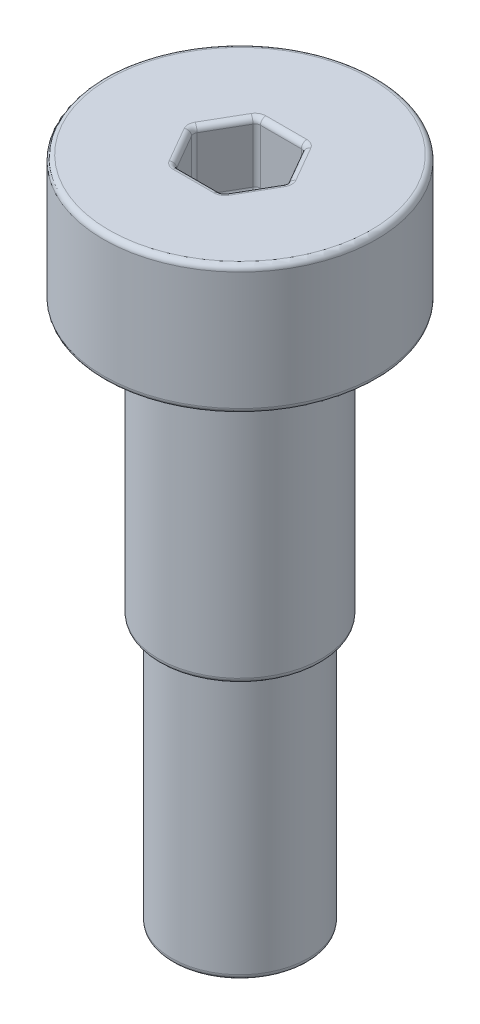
ISO-10303-21;
HEADER;
FILE_DESCRIPTION(('STEP AP214'),'2;1');
FILE_NAME('part.step','',(''),(''),'','','');
FILE_SCHEMA(('AUTOMOTIVE_DESIGN { 1 0 10303 214 1 1 1 1 }'));
ENDSEC;
DATA;
#1=APPLICATION_CONTEXT('core data for automotive mechanical design processes');
#2=APPLICATION_PROTOCOL_DEFINITION('international standard','automotive_design',2000,#1);
#3=PRODUCT_CONTEXT('',#1,'mechanical');
#4=PRODUCT('Part','Part','',(#3));
#5=PRODUCT_RELATED_PRODUCT_CATEGORY('part','',(#4));
#6=PRODUCT_DEFINITION_FORMATION('','',#4);
#7=PRODUCT_DEFINITION_CONTEXT('part definition',#1,'design');
#8=PRODUCT_DEFINITION('design','',#6,#7);
#9=PRODUCT_DEFINITION_SHAPE('','',#8);
#10=(LENGTH_UNIT() NAMED_UNIT(*) SI_UNIT(.MILLI.,.METRE.));
#11=(NAMED_UNIT(*) PLANE_ANGLE_UNIT() SI_UNIT($,.RADIAN.));
#12=(NAMED_UNIT(*) SI_UNIT($,.STERADIAN.) SOLID_ANGLE_UNIT());
#13=UNCERTAINTY_MEASURE_WITH_UNIT(LENGTH_MEASURE(1.E-05),#10,'distance_accuracy_value','');
#14=(GEOMETRIC_REPRESENTATION_CONTEXT(3) GLOBAL_UNCERTAINTY_ASSIGNED_CONTEXT((#13)) GLOBAL_UNIT_ASSIGNED_CONTEXT((#10,
#11,#12)) REPRESENTATION_CONTEXT('',''));
#15=CARTESIAN_POINT('',(0.,0.,0.));
#16=DIRECTION('',(0.,0.,1.));
#17=DIRECTION('',(1.,0.,0.));
#18=AXIS2_PLACEMENT_3D('',#15,#16,#17);
#19=CARTESIAN_POINT('',(0.,-5.,0.));
#20=DIRECTION('',(0.,1.,0.));
#21=DIRECTION('',(0.,0.,1.));
#22=AXIS2_PLACEMENT_3D('',#19,#20,#21);
#23=CYLINDRICAL_SURFACE('',#22,2.98);
#24=CARTESIAN_POINT('',(0.,-4.8,0.));
#25=DIRECTION('',(0.,1.,0.));
#26=DIRECTION('',(0.,0.,1.));
#27=AXIS2_PLACEMENT_3D('',#24,#25,#26);
#28=CIRCLE('',#27,2.98);
#29=CARTESIAN_POINT('',(0.,-4.8,2.98));
#30=VERTEX_POINT('',#29);
#31=EDGE_CURVE('E367',#30,#30,#28,.T.);
#32=ORIENTED_EDGE('',*,*,#31,.T.);
#33=EDGE_LOOP('',(#32));
#34=FACE_BOUND('',#33,.T.);
#35=CARTESIAN_POINT('',(0.,5.,0.));
#36=DIRECTION('',(0.,1.,0.));
#37=DIRECTION('',(0.,0.,1.));
#38=AXIS2_PLACEMENT_3D('',#35,#36,#37);
#39=CIRCLE('',#38,2.98);
#40=CARTESIAN_POINT('',(0.,5.,2.98));
#41=VERTEX_POINT('',#40);
#42=EDGE_CURVE('E202',#41,#41,#39,.T.);
#43=ORIENTED_EDGE('',*,*,#42,.F.);
#44=EDGE_LOOP('',(#43));
#45=FACE_BOUND('',#44,.T.);
#46=ADVANCED_FACE('F35',(#34,#45),#23,.T.);
#47=CARTESIAN_POINT('',(0.,-5.,0.));
#48=DIRECTION('',(0.,1.,0.));
#49=DIRECTION('',(0.,0.,1.));
#50=AXIS2_PLACEMENT_3D('',#47,#48,#49);
#51=PLANE('',#50);
#52=CARTESIAN_POINT('',(0.,-5.,0.));
#53=DIRECTION('',(0.,1.,0.));
#54=DIRECTION('',(0.,0.,1.));
#55=AXIS2_PLACEMENT_3D('',#52,#53,#54);
#56=CIRCLE('',#55,2.7);
#57=CARTESIAN_POINT('',(0.,-5.,2.7));
#58=VERTEX_POINT('',#57);
#59=EDGE_CURVE('E364',#58,#58,#56,.T.);
#60=ORIENTED_EDGE('',*,*,#59,.T.);
#61=EDGE_LOOP('',(#60));
#62=FACE_BOUND('',#61,.T.);
#63=CARTESIAN_POINT('',(0.,-5.,0.));
#64=DIRECTION('',(0.,1.,0.));
#65=DIRECTION('',(0.,0.,1.));
#66=AXIS2_PLACEMENT_3D('',#63,#64,#65);
#67=CIRCLE('',#66,2.78);
#68=CARTESIAN_POINT('',(0.,-5.,2.78));
#69=VERTEX_POINT('',#68);
#70=EDGE_CURVE('E361',#69,#69,#67,.F.);
#71=ORIENTED_EDGE('',*,*,#70,.T.);
#72=EDGE_LOOP('',(#71));
#73=FACE_BOUND('',#72,.T.);
#74=ADVANCED_FACE('F496',(#62,#73),#51,.F.);
#75=CARTESIAN_POINT('',(0.,9.73,0.));
#76=DIRECTION('',(0.,-1.,0.));
#77=DIRECTION('',(0.,0.,-1.));
#78=AXIS2_PLACEMENT_3D('',#75,#76,#77);
#79=CYLINDRICAL_SURFACE('',#78,5.005);
#80=CARTESIAN_POINT('',(0.,5.2,0.));
#81=DIRECTION('',(0.,1.,0.));
#82=DIRECTION('',(0.,0.,1.));
#83=AXIS2_PLACEMENT_3D('',#80,#81,#82);
#84=CIRCLE('',#83,5.005);
#85=CARTESIAN_POINT('',(0.,5.2,-5.005));
#86=VERTEX_POINT('',#85);
#87=EDGE_CURVE('E44',#86,#86,#84,.T.);
#88=CARTESIAN_POINT('',(0.,9.53,0.));
#89=DIRECTION('',(0.,1.,0.));
#90=DIRECTION('',(0.,0.,1.));
#91=AXIS2_PLACEMENT_3D('',#88,#89,#90);
#92=CIRCLE('',#91,5.005);
#93=CARTESIAN_POINT('',(0.,9.53,-5.005));
#94=VERTEX_POINT('',#93);
#95=EDGE_CURVE('E370',#94,#94,#92,.F.);
#96=CARTESIAN_POINT('',(0.,5.2,-5.005));
#97=CARTESIAN_POINT('',(0.,5.24510416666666,-5.005));
#98=CARTESIAN_POINT('',(0.,5.29020833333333,-5.005));
#99=CARTESIAN_POINT('',(0.,5.38041666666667,-5.005));
#100=CARTESIAN_POINT('',(0.,5.42552083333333,-5.005));
#101=CARTESIAN_POINT('',(0.,5.51572916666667,-5.005));
#102=CARTESIAN_POINT('',(0.,5.56083333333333,-5.005));
#103=CARTESIAN_POINT('',(0.,5.65104166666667,-5.005));
#104=CARTESIAN_POINT('',(0.,5.69614583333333,-5.005));
#105=CARTESIAN_POINT('',(0.,5.78635416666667,-5.005));
#106=CARTESIAN_POINT('',(0.,5.83145833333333,-5.005));
#107=CARTESIAN_POINT('',(0.,5.92166666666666,-5.005));
#108=CARTESIAN_POINT('',(0.,5.96677083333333,-5.005));
#109=CARTESIAN_POINT('',(0.,6.05697916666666,-5.005));
#110=CARTESIAN_POINT('',(0.,6.10208333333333,-5.005));
#111=CARTESIAN_POINT('',(0.,6.19229166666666,-5.005));
#112=CARTESIAN_POINT('',(0.,6.23739583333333,-5.005));
#113=CARTESIAN_POINT('',(0.,6.32760416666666,-5.005));
#114=CARTESIAN_POINT('',(0.,6.37270833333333,-5.005));
#115=CARTESIAN_POINT('',(0.,6.46291666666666,-5.005));
#116=CARTESIAN_POINT('',(0.,6.50802083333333,-5.005));
#117=CARTESIAN_POINT('',(0.,6.59822916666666,-5.005));
#118=CARTESIAN_POINT('',(0.,6.64333333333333,-5.005));
#119=CARTESIAN_POINT('',(0.,6.73354166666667,-5.005));
#120=CARTESIAN_POINT('',(0.,6.77864583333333,-5.005));
#121=CARTESIAN_POINT('',(0.,6.86885416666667,-5.005));
#122=CARTESIAN_POINT('',(0.,6.91395833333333,-5.005));
#123=CARTESIAN_POINT('',(0.,7.00416666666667,-5.005));
#124=CARTESIAN_POINT('',(0.,7.04927083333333,-5.005));
#125=CARTESIAN_POINT('',(0.,7.13947916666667,-5.005));
#126=CARTESIAN_POINT('',(0.,7.18458333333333,-5.005));
#127=CARTESIAN_POINT('',(0.,7.27479166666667,-5.005));
#128=CARTESIAN_POINT('',(0.,7.31989583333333,-5.005));
#129=CARTESIAN_POINT('',(0.,7.41010416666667,-5.005));
#130=CARTESIAN_POINT('',(0.,7.45520833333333,-5.005));
#131=CARTESIAN_POINT('',(0.,7.54541666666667,-5.005));
#132=CARTESIAN_POINT('',(0.,7.59052083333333,-5.005));
#133=CARTESIAN_POINT('',(0.,7.68072916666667,-5.005));
#134=CARTESIAN_POINT('',(0.,7.72583333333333,-5.005));
#135=CARTESIAN_POINT('',(0.,7.81604166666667,-5.005));
#136=CARTESIAN_POINT('',(0.,7.86114583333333,-5.005));
#137=CARTESIAN_POINT('',(0.,7.95135416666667,-5.005));
#138=CARTESIAN_POINT('',(0.,7.99645833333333,-5.005));
#139=CARTESIAN_POINT('',(0.,8.08666666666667,-5.005));
#140=CARTESIAN_POINT('',(0.,8.13177083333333,-5.005));
#141=CARTESIAN_POINT('',(0.,8.22197916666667,-5.005));
#142=CARTESIAN_POINT('',(0.,8.26708333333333,-5.005));
#143=CARTESIAN_POINT('',(0.,8.35729166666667,-5.005));
#144=CARTESIAN_POINT('',(0.,8.40239583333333,-5.005));
#145=CARTESIAN_POINT('',(0.,8.49260416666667,-5.005));
#146=CARTESIAN_POINT('',(0.,8.53770833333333,-5.005));
#147=CARTESIAN_POINT('',(0.,8.62791666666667,-5.005));
#148=CARTESIAN_POINT('',(0.,8.67302083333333,-5.005));
#149=CARTESIAN_POINT('',(0.,8.76322916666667,-5.005));
#150=CARTESIAN_POINT('',(0.,8.80833333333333,-5.005));
#151=CARTESIAN_POINT('',(0.,8.89854166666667,-5.005));
#152=CARTESIAN_POINT('',(0.,8.94364583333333,-5.005));
#153=CARTESIAN_POINT('',(0.,9.03385416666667,-5.005));
#154=CARTESIAN_POINT('',(0.,9.07895833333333,-5.005));
#155=CARTESIAN_POINT('',(0.,9.16916666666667,-5.005));
#156=CARTESIAN_POINT('',(0.,9.21427083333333,-5.005));
#157=CARTESIAN_POINT('',(0.,9.30447916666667,-5.005));
#158=CARTESIAN_POINT('',(0.,9.34958333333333,-5.005));
#159=CARTESIAN_POINT('',(0.,9.43979166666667,-5.005));
#160=CARTESIAN_POINT('',(0.,9.48489583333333,-5.005));
#161=CARTESIAN_POINT('',(0.,9.53,-5.005));
#162=B_SPLINE_CURVE_WITH_KNOTS('',3,(#96,#97,#98,#99,#100,#101,#102,#103,#104,#105,#106,#107,
#108,#109,#110,#111,#112,#113,#114,#115,#116,#117,#118,#119,#120,#121,#122,#123,#124,#125,#126,
#127,#128,#129,#130,#131,#132,#133,#134,#135,#136,#137,#138,#139,#140,#141,#142,#143,#144,#145,
#146,#147,#148,#149,#150,#151,#152,#153,#154,#155,#156,#157,#158,#159,#160,#161),.UNSPECIFIED.,
.F.,.F.,(4,2,2,2,2,2,2,2,2,2,2,2,2,2,2,2,2,2,2,2,2,2,2,2,2,2,2,2,2,2,2,2,4),(0.,0.1353125,
0.270625,0.4059375,0.54125,0.676562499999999,0.811874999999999,0.947187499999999,1.0825,
1.2178125,1.353125,1.4884375,1.62375,1.7590625,1.894375,2.0296875,2.165,2.3003125,2.435625,
2.5709375,2.70625,2.8415625,2.976875,3.1121875,3.2475,3.3828125,3.518125,3.6534375,3.78875,
3.9240625,4.059375,4.1946875,4.33),.UNSPECIFIED.);
#163=EDGE_CURVE('BSEAM502',#86,#94,#162,.T.);
#164=ORIENTED_EDGE('',*,*,#87,.T.);
#165=ORIENTED_EDGE('',*,*,#95,.T.);
#166=ORIENTED_EDGE('',*,*,#163,.T.);
#167=ORIENTED_EDGE('',*,*,#163,.F.);
#168=EDGE_LOOP('',(#164,#166,#165,#167));
#169=FACE_BOUND('',#168,.T.);
#170=ADVANCED_FACE('F502',(#169),#79,.T.);
#171=CARTESIAN_POINT('',(0.,9.73,0.));
#172=DIRECTION('',(0.,1.,0.));
#173=DIRECTION('',(0.,0.,1.));
#174=AXIS2_PLACEMENT_3D('',#171,#172,#173);
#175=PLANE('',#174);
#176=CARTESIAN_POINT('',(1.50111069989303,9.73,0.));
#177=DIRECTION('',(0.,1.,0.));
#178=DIRECTION('',(0.,0.,1.));
#179=AXIS2_PLACEMENT_3D('',#176,#177,#178);
#180=CIRCLE('',#179,0.4);
#181=CARTESIAN_POINT('',(1.8475208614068,9.73,0.2));
#182=VERTEX_POINT('',#181);
#183=CARTESIAN_POINT('',(1.8475208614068,9.73,-0.2));
#184=VERTEX_POINT('',#183);
#185=EDGE_CURVE('E303',#182,#184,#180,.T.);
#186=ORIENTED_EDGE('',*,*,#185,.F.);
#187=DIRECTION('',(0.5,0.,-0.866025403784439));
#188=VECTOR('',#187,1.);
#189=CARTESIAN_POINT('',(1.03923048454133,9.73,1.6));
#190=LINE('',#189,#188);
#191=CARTESIAN_POINT('',(1.09696551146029,9.73,1.5));
#192=VERTEX_POINT('',#191);
#193=EDGE_CURVE('E309',#182,#192,#190,.F.);
#194=ORIENTED_EDGE('',*,*,#193,.T.);
#195=CARTESIAN_POINT('',(0.750555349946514,9.73,1.3));
#196=DIRECTION('',(0.,1.,0.));
#197=DIRECTION('',(0.,0.,1.));
#198=AXIS2_PLACEMENT_3D('',#195,#196,#197);
#199=CIRCLE('',#198,0.4);
#200=CARTESIAN_POINT('',(0.750555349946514,9.73,1.7));
#201=VERTEX_POINT('',#200);
#202=EDGE_CURVE('E306',#201,#192,#199,.T.);
#203=ORIENTED_EDGE('',*,*,#202,.F.);
#204=DIRECTION('',(1.,0.,0.));
#205=VECTOR('',#204,1.);
#206=CARTESIAN_POINT('',(-0.866025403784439,9.73,1.7));
#207=LINE('',#206,#205);
#208=CARTESIAN_POINT('',(-0.750555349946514,9.73,1.7));
#209=VERTEX_POINT('',#208);
#210=EDGE_CURVE('E300',#201,#209,#207,.F.);
#211=ORIENTED_EDGE('',*,*,#210,.T.);
#212=CARTESIAN_POINT('',(-0.750555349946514,9.73,1.3));
#213=DIRECTION('',(0.,1.,0.));
#214=DIRECTION('',(0.,0.,1.));
#215=AXIS2_PLACEMENT_3D('',#212,#213,#214);
#216=CIRCLE('',#215,0.4);
#217=CARTESIAN_POINT('',(-1.09696551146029,9.73,1.5));
#218=VERTEX_POINT('',#217);
#219=EDGE_CURVE('E298',#218,#209,#216,.T.);
#220=ORIENTED_EDGE('',*,*,#219,.F.);
#221=DIRECTION('',(0.5,0.,0.866025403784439));
#222=VECTOR('',#221,1.);
#223=CARTESIAN_POINT('',(-1.90525588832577,9.73,0.1));
#224=LINE('',#223,#222);
#225=CARTESIAN_POINT('',(-1.8475208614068,9.73,0.2));
#226=VERTEX_POINT('',#225);
#227=EDGE_CURVE('E294',#218,#226,#224,.F.);
#228=ORIENTED_EDGE('',*,*,#227,.T.);
#229=CARTESIAN_POINT('',(-1.50111069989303,9.73,0.));
#230=DIRECTION('',(0.,1.,0.));
#231=DIRECTION('',(0.,0.,1.));
#232=AXIS2_PLACEMENT_3D('',#229,#230,#231);
#233=CIRCLE('',#232,0.4);
#234=CARTESIAN_POINT('',(-1.8475208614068,9.73,-0.2));
#235=VERTEX_POINT('',#234);
#236=EDGE_CURVE('E291',#235,#226,#233,.T.);
#237=ORIENTED_EDGE('',*,*,#236,.F.);
#238=DIRECTION('',(-0.5,0.,0.866025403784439));
#239=VECTOR('',#238,1.);
#240=CARTESIAN_POINT('',(-1.03923048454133,9.73,-1.6));
#241=LINE('',#240,#239);
#242=CARTESIAN_POINT('',(-1.09696551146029,9.73,-1.5));
#243=VERTEX_POINT('',#242);
#244=EDGE_CURVE('E289',#235,#243,#241,.F.);
#245=ORIENTED_EDGE('',*,*,#244,.T.);
#246=CARTESIAN_POINT('',(-0.750555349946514,9.73,-1.3));
#247=DIRECTION('',(0.,1.,0.));
#248=DIRECTION('',(0.,0.,1.));
#249=AXIS2_PLACEMENT_3D('',#246,#247,#248);
#250=CIRCLE('',#249,0.4);
#251=CARTESIAN_POINT('',(-0.750555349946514,9.73,-1.7));
#252=VERTEX_POINT('',#251);
#253=EDGE_CURVE('E287',#252,#243,#250,.T.);
#254=ORIENTED_EDGE('',*,*,#253,.F.);
#255=DIRECTION('',(-1.,0.,0.));
#256=VECTOR('',#255,1.);
#257=CARTESIAN_POINT('',(0.866025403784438,9.73,-1.7));
#258=LINE('',#257,#256);
#259=CARTESIAN_POINT('',(0.750555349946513,9.73,-1.7));
#260=VERTEX_POINT('',#259);
#261=EDGE_CURVE('E285',#252,#260,#258,.F.);
#262=ORIENTED_EDGE('',*,*,#261,.T.);
#263=CARTESIAN_POINT('',(0.750555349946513,9.73,-1.3));
#264=DIRECTION('',(0.,1.,0.));
#265=DIRECTION('',(0.,0.,1.));
#266=AXIS2_PLACEMENT_3D('',#263,#264,#265);
#267=CIRCLE('',#266,0.4);
#268=CARTESIAN_POINT('',(1.09696551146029,9.73,-1.5));
#269=VERTEX_POINT('',#268);
#270=EDGE_CURVE('E283',#269,#260,#267,.T.);
#271=ORIENTED_EDGE('',*,*,#270,.F.);
#272=DIRECTION('',(-0.5,0.,-0.866025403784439));
#273=VECTOR('',#272,1.);
#274=CARTESIAN_POINT('',(1.90525588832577,9.73,-0.1));
#275=LINE('',#274,#273);
#276=EDGE_CURVE('E296',#269,#184,#275,.F.);
#277=ORIENTED_EDGE('',*,*,#276,.T.);
#278=EDGE_LOOP('',(#186,#194,#203,#211,#220,#228,#237,#245,#254,#262,#271,#277));
#279=FACE_BOUND('',#278,.T.);
#280=CARTESIAN_POINT('',(0.,9.73,0.));
#281=DIRECTION('',(0.,1.,0.));
#282=DIRECTION('',(0.,0.,1.));
#283=AXIS2_PLACEMENT_3D('',#280,#281,#282);
#284=CIRCLE('',#283,4.805);
#285=CARTESIAN_POINT('',(0.,9.73,4.805));
#286=VERTEX_POINT('',#285);
#287=EDGE_CURVE('E280',#286,#286,#284,.T.);
#288=ORIENTED_EDGE('',*,*,#287,.T.);
#289=EDGE_LOOP('',(#288));
#290=FACE_BOUND('',#289,.T.);
#291=ADVANCED_FACE('F473',(#279,#290),#175,.T.);
#292=CARTESIAN_POINT('',(0.,5.,0.));
#293=DIRECTION('',(0.,1.,0.));
#294=DIRECTION('',(0.,0.,1.));
#295=AXIS2_PLACEMENT_3D('',#292,#293,#294);
#296=PLANE('',#295);
#297=CARTESIAN_POINT('',(0.,5.,0.));
#298=DIRECTION('',(0.,1.,0.));
#299=DIRECTION('',(0.,0.,1.));
#300=AXIS2_PLACEMENT_3D('',#297,#298,#299);
#301=CIRCLE('',#300,4.805);
#302=CARTESIAN_POINT('',(0.,5.,4.805));
#303=VERTEX_POINT('',#302);
#304=EDGE_CURVE('E11',#303,#303,#301,.F.);
#305=ORIENTED_EDGE('',*,*,#304,.T.);
#306=EDGE_LOOP('',(#305));
#307=FACE_BOUND('',#306,.T.);
#308=ORIENTED_EDGE('',*,*,#42,.T.);
#309=EDGE_LOOP('',(#308));
#310=FACE_BOUND('',#309,.T.);
#311=ADVANCED_FACE('F573',(#307,#310),#296,.F.);
#312=CARTESIAN_POINT('',(0.866025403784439,7.33,1.5));
#313=DIRECTION('',(0.866025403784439,0.,0.5));
#314=DIRECTION('',(0.5,0.,-0.866025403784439));
#315=AXIS2_PLACEMENT_3D('',#312,#313,#314);
#316=PLANE('',#315);
#317=DIRECTION('',(0.5,0.,-0.866025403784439));
#318=VECTOR('',#317,1.);
#319=CARTESIAN_POINT('',(0.866025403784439,7.53,1.5));
#320=LINE('',#319,#318);
#321=CARTESIAN_POINT('',(1.67431578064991,7.53,0.0999999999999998));
#322=VERTEX_POINT('',#321);
#323=CARTESIAN_POINT('',(0.923760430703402,7.53,1.4));
#324=VERTEX_POINT('',#323);
#325=EDGE_CURVE('E315',#322,#324,#320,.F.);
#326=ORIENTED_EDGE('',*,*,#325,.T.);
#327=DIRECTION('',(0.,1.,0.));
#328=VECTOR('',#327,1.);
#329=CARTESIAN_POINT('',(0.923760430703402,9.73,1.4));
#330=LINE('',#329,#328);
#331=CARTESIAN_POINT('',(0.923760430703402,9.53,1.4));
#332=VERTEX_POINT('',#331);
#333=EDGE_CURVE('E317',#324,#332,#330,.T.);
#334=ORIENTED_EDGE('',*,*,#333,.T.);
#335=DIRECTION('',(0.5,0.,-0.866025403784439));
#336=VECTOR('',#335,1.);
#337=CARTESIAN_POINT('',(1.73205080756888,9.53,0.));
#338=LINE('',#337,#336);
#339=CARTESIAN_POINT('',(1.67431578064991,9.53,0.0999999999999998));
#340=VERTEX_POINT('',#339);
#341=EDGE_CURVE('E313',#332,#340,#338,.T.);
#342=ORIENTED_EDGE('',*,*,#341,.T.);
#343=DIRECTION('',(0.,1.,0.));
#344=VECTOR('',#343,1.);
#345=CARTESIAN_POINT('',(1.67431578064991,7.33,0.0999999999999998));
#346=LINE('',#345,#344);
#347=EDGE_CURVE('E311',#340,#322,#346,.F.);
#348=ORIENTED_EDGE('',*,*,#347,.T.);
#349=EDGE_LOOP('',(#326,#334,#342,#348));
#350=FACE_BOUND('',#349,.T.);
#351=ADVANCED_FACE('F442',(#350),#316,.F.);
#352=CARTESIAN_POINT('',(-0.866025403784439,7.33,1.5));
#353=DIRECTION('',(0.,0.,1.));
#354=DIRECTION('',(1.,0.,0.));
#355=AXIS2_PLACEMENT_3D('',#352,#353,#354);
#356=PLANE('',#355);
#357=DIRECTION('',(1.,0.,0.));
#358=VECTOR('',#357,1.);
#359=CARTESIAN_POINT('',(0.866025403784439,9.53,1.5));
#360=LINE('',#359,#358);
#361=CARTESIAN_POINT('',(-0.750555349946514,9.53,1.5));
#362=VERTEX_POINT('',#361);
#363=CARTESIAN_POINT('',(0.750555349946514,9.53,1.5));
#364=VERTEX_POINT('',#363);
#365=EDGE_CURVE('E273',#362,#364,#360,.T.);
#366=ORIENTED_EDGE('',*,*,#365,.T.);
#367=DIRECTION('',(0.,1.,0.));
#368=VECTOR('',#367,1.);
#369=CARTESIAN_POINT('',(0.750555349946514,7.33,1.5));
#370=LINE('',#369,#368);
#371=CARTESIAN_POINT('',(0.750555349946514,7.53,1.5));
#372=VERTEX_POINT('',#371);
#373=EDGE_CURVE('E278',#364,#372,#370,.F.);
#374=ORIENTED_EDGE('',*,*,#373,.T.);
#375=DIRECTION('',(1.,0.,0.));
#376=VECTOR('',#375,1.);
#377=CARTESIAN_POINT('',(-0.866025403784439,7.53,1.5));
#378=LINE('',#377,#376);
#379=CARTESIAN_POINT('',(-0.750555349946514,7.53,1.5));
#380=VERTEX_POINT('',#379);
#381=EDGE_CURVE('E275',#372,#380,#378,.F.);
#382=ORIENTED_EDGE('',*,*,#381,.T.);
#383=DIRECTION('',(0.,1.,0.));
#384=VECTOR('',#383,1.);
#385=CARTESIAN_POINT('',(-0.750555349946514,9.73,1.5));
#386=LINE('',#385,#384);
#387=EDGE_CURVE('E271',#380,#362,#386,.T.);
#388=ORIENTED_EDGE('',*,*,#387,.T.);
#389=EDGE_LOOP('',(#366,#374,#382,#388));
#390=FACE_BOUND('',#389,.T.);
#391=ADVANCED_FACE('F462',(#390),#356,.F.);
#392=CARTESIAN_POINT('',(-1.73205080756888,7.33,0.));
#393=DIRECTION('',(-0.866025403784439,0.,0.5));
#394=DIRECTION('',(0.5,0.,0.866025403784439));
#395=AXIS2_PLACEMENT_3D('',#392,#393,#394);
#396=PLANE('',#395);
#397=DIRECTION('',(0.,1.,0.));
#398=VECTOR('',#397,1.);
#399=CARTESIAN_POINT('',(-0.923760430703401,7.33,1.4));
#400=LINE('',#399,#398);
#401=CARTESIAN_POINT('',(-0.923760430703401,9.53,1.4));
#402=VERTEX_POINT('',#401);
#403=CARTESIAN_POINT('',(-0.923760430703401,7.53,1.4));
#404=VERTEX_POINT('',#403);
#405=EDGE_CURVE('E332',#402,#404,#400,.F.);
#406=ORIENTED_EDGE('',*,*,#405,.T.);
#407=DIRECTION('',(0.5,0.,0.866025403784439));
#408=VECTOR('',#407,1.);
#409=CARTESIAN_POINT('',(-1.73205080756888,7.53,0.));
#410=LINE('',#409,#408);
#411=CARTESIAN_POINT('',(-1.67431578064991,7.53,0.1));
#412=VERTEX_POINT('',#411);
#413=EDGE_CURVE('E334',#404,#412,#410,.F.);
#414=ORIENTED_EDGE('',*,*,#413,.T.);
#415=DIRECTION('',(0.,1.,0.));
#416=VECTOR('',#415,1.);
#417=CARTESIAN_POINT('',(-1.67431578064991,9.73,0.1));
#418=LINE('',#417,#416);
#419=CARTESIAN_POINT('',(-1.67431578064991,9.53,0.1));
#420=VERTEX_POINT('',#419);
#421=EDGE_CURVE('E328',#412,#420,#418,.T.);
#422=ORIENTED_EDGE('',*,*,#421,.T.);
#423=DIRECTION('',(0.5,0.,0.866025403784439));
#424=VECTOR('',#423,1.);
#425=CARTESIAN_POINT('',(-0.866025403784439,9.53,1.5));
#426=LINE('',#425,#424);
#427=EDGE_CURVE('E330',#420,#402,#426,.T.);
#428=ORIENTED_EDGE('',*,*,#427,.T.);
#429=EDGE_LOOP('',(#406,#414,#422,#428));
#430=FACE_BOUND('',#429,.T.);
#431=ADVANCED_FACE('F566',(#430),#396,.F.);
#432=CARTESIAN_POINT('',(-0.866025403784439,7.33,-1.5));
#433=DIRECTION('',(-0.866025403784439,0.,-0.5));
#434=DIRECTION('',(-0.5,0.,0.866025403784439));
#435=AXIS2_PLACEMENT_3D('',#432,#433,#434);
#436=PLANE('',#435);
#437=DIRECTION('',(0.,1.,0.));
#438=VECTOR('',#437,1.);
#439=CARTESIAN_POINT('',(-1.67431578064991,7.33,-0.0999999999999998));
#440=LINE('',#439,#438);
#441=CARTESIAN_POINT('',(-1.67431578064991,9.53,-0.0999999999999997));
#442=VERTEX_POINT('',#441);
#443=CARTESIAN_POINT('',(-1.67431578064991,7.53,-0.0999999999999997));
#444=VERTEX_POINT('',#443);
#445=EDGE_CURVE('E341',#442,#444,#440,.F.);
#446=ORIENTED_EDGE('',*,*,#445,.T.);
#447=DIRECTION('',(-0.5,0.,0.866025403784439));
#448=VECTOR('',#447,1.);
#449=CARTESIAN_POINT('',(-0.866025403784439,7.53,-1.5));
#450=LINE('',#449,#448);
#451=CARTESIAN_POINT('',(-0.923760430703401,7.53,-1.4));
#452=VERTEX_POINT('',#451);
#453=EDGE_CURVE('E343',#444,#452,#450,.F.);
#454=ORIENTED_EDGE('',*,*,#453,.T.);
#455=DIRECTION('',(0.,1.,0.));
#456=VECTOR('',#455,1.);
#457=CARTESIAN_POINT('',(-0.923760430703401,9.73,-1.4));
#458=LINE('',#457,#456);
#459=CARTESIAN_POINT('',(-0.923760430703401,9.53,-1.4));
#460=VERTEX_POINT('',#459);
#461=EDGE_CURVE('E337',#452,#460,#458,.T.);
#462=ORIENTED_EDGE('',*,*,#461,.T.);
#463=DIRECTION('',(-0.5,0.,0.866025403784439));
#464=VECTOR('',#463,1.);
#465=CARTESIAN_POINT('',(-1.73205080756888,9.53,0.));
#466=LINE('',#465,#464);
#467=EDGE_CURVE('E339',#460,#442,#466,.T.);
#468=ORIENTED_EDGE('',*,*,#467,.T.);
#469=EDGE_LOOP('',(#446,#454,#462,#468));
#470=FACE_BOUND('',#469,.T.);
#471=ADVANCED_FACE('F559',(#470),#436,.F.);
#472=CARTESIAN_POINT('',(0.866025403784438,7.33,-1.5));
#473=DIRECTION('',(0.,0.,-1.));
#474=DIRECTION('',(-1.,0.,0.));
#475=AXIS2_PLACEMENT_3D('',#472,#473,#474);
#476=PLANE('',#475);
#477=DIRECTION('',(-1.,0.,0.));
#478=VECTOR('',#477,1.);
#479=CARTESIAN_POINT('',(0.866025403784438,7.53,-1.5));
#480=LINE('',#479,#478);
#481=CARTESIAN_POINT('',(-0.750555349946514,7.53,-1.5));
#482=VERTEX_POINT('',#481);
#483=CARTESIAN_POINT('',(0.750555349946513,7.53,-1.5));
#484=VERTEX_POINT('',#483);
#485=EDGE_CURVE('E52',#482,#484,#480,.F.);
#486=ORIENTED_EDGE('',*,*,#485,.T.);
#487=DIRECTION('',(0.,1.,0.));
#488=VECTOR('',#487,1.);
#489=CARTESIAN_POINT('',(0.750555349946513,9.73,-1.5));
#490=LINE('',#489,#488);
#491=CARTESIAN_POINT('',(0.750555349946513,9.53,-1.5));
#492=VERTEX_POINT('',#491);
#493=EDGE_CURVE('E350',#484,#492,#490,.T.);
#494=ORIENTED_EDGE('',*,*,#493,.T.);
#495=DIRECTION('',(-1.,0.,0.));
#496=VECTOR('',#495,1.);
#497=CARTESIAN_POINT('',(-0.866025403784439,9.53,-1.5));
#498=LINE('',#497,#496);
#499=CARTESIAN_POINT('',(-0.750555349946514,9.53,-1.5));
#500=VERTEX_POINT('',#499);
#501=EDGE_CURVE('E346',#492,#500,#498,.T.);
#502=ORIENTED_EDGE('',*,*,#501,.T.);
#503=DIRECTION('',(0.,1.,0.));
#504=VECTOR('',#503,1.);
#505=CARTESIAN_POINT('',(-0.750555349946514,7.33,-1.5));
#506=LINE('',#505,#504);
#507=EDGE_CURVE('E57',#500,#482,#506,.F.);
#508=ORIENTED_EDGE('',*,*,#507,.T.);
#509=EDGE_LOOP('',(#486,#494,#502,#508));
#510=FACE_BOUND('',#509,.T.);
#511=ADVANCED_FACE('F557',(#510),#476,.F.);
#512=CARTESIAN_POINT('',(1.73205080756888,7.33,0.));
#513=DIRECTION('',(0.866025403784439,0.,-0.5));
#514=DIRECTION('',(-0.5,0.,-0.866025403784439));
#515=AXIS2_PLACEMENT_3D('',#512,#513,#514);
#516=PLANE('',#515);
#517=DIRECTION('',(-0.5,0.,-0.866025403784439));
#518=VECTOR('',#517,1.);
#519=CARTESIAN_POINT('',(1.73205080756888,7.53,0.));
#520=LINE('',#519,#518);
#521=CARTESIAN_POINT('',(0.923760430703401,7.53,-1.4));
#522=VERTEX_POINT('',#521);
#523=CARTESIAN_POINT('',(1.67431578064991,7.53,-0.1));
#524=VERTEX_POINT('',#523);
#525=EDGE_CURVE('E213',#522,#524,#520,.F.);
#526=ORIENTED_EDGE('',*,*,#525,.T.);
#527=DIRECTION('',(0.,1.,0.));
#528=VECTOR('',#527,1.);
#529=CARTESIAN_POINT('',(1.67431578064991,9.73,-0.1));
#530=LINE('',#529,#528);
#531=CARTESIAN_POINT('',(1.67431578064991,9.53,-0.1));
#532=VERTEX_POINT('',#531);
#533=EDGE_CURVE('E325',#524,#532,#530,.T.);
#534=ORIENTED_EDGE('',*,*,#533,.T.);
#535=DIRECTION('',(-0.5,0.,-0.866025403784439));
#536=VECTOR('',#535,1.);
#537=CARTESIAN_POINT('',(0.866025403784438,9.53,-1.5));
#538=LINE('',#537,#536);
#539=CARTESIAN_POINT('',(0.923760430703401,9.53,-1.4));
#540=VERTEX_POINT('',#539);
#541=EDGE_CURVE('E322',#532,#540,#538,.T.);
#542=ORIENTED_EDGE('',*,*,#541,.T.);
#543=DIRECTION('',(0.,1.,0.));
#544=VECTOR('',#543,1.);
#545=CARTESIAN_POINT('',(0.923760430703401,7.33,-1.4));
#546=LINE('',#545,#544);
#547=EDGE_CURVE('E320',#540,#522,#546,.F.);
#548=ORIENTED_EDGE('',*,*,#547,.T.);
#549=EDGE_LOOP('',(#526,#534,#542,#548));
#550=FACE_BOUND('',#549,.T.);
#551=ADVANCED_FACE('F480',(#550),#516,.F.);
#552=CARTESIAN_POINT('',(0.,7.33,0.));
#553=DIRECTION('',(0.,1.,0.));
#554=DIRECTION('',(0.,0.,1.));
#555=AXIS2_PLACEMENT_3D('',#552,#553,#554);
#556=PLANE('',#555);
#557=DIRECTION('',(0.5,0.,0.866025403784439));
#558=VECTOR('',#557,1.);
#559=CARTESIAN_POINT('',(-1.12583302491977,7.33,0.65));
#560=LINE('',#559,#558);
#561=CARTESIAN_POINT('',(-1.50111069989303,7.33,0.));
#562=VERTEX_POINT('',#561);
#563=CARTESIAN_POINT('',(-0.750555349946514,7.33,1.3));
#564=VERTEX_POINT('',#563);
#565=EDGE_CURVE('E190',#562,#564,#560,.T.);
#566=ORIENTED_EDGE('',*,*,#565,.T.);
#567=DIRECTION('',(1.,0.,0.));
#568=VECTOR('',#567,1.);
#569=CARTESIAN_POINT('',(0.,7.33,1.3));
#570=LINE('',#569,#568);
#571=CARTESIAN_POINT('',(0.750555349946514,7.33,1.3));
#572=VERTEX_POINT('',#571);
#573=EDGE_CURVE('E269',#564,#572,#570,.T.);
#574=ORIENTED_EDGE('',*,*,#573,.T.);
#575=DIRECTION('',(0.5,0.,-0.866025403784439));
#576=VECTOR('',#575,1.);
#577=CARTESIAN_POINT('',(1.12583302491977,7.33,0.65));
#578=LINE('',#577,#576);
#579=CARTESIAN_POINT('',(1.50111069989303,7.33,0.));
#580=VERTEX_POINT('',#579);
#581=EDGE_CURVE('E185',#572,#580,#578,.T.);
#582=ORIENTED_EDGE('',*,*,#581,.T.);
#583=DIRECTION('',(-0.5,0.,-0.866025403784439));
#584=VECTOR('',#583,1.);
#585=CARTESIAN_POINT('',(1.12583302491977,7.33,-0.65));
#586=LINE('',#585,#584);
#587=CARTESIAN_POINT('',(0.750555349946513,7.33,-1.3));
#588=VERTEX_POINT('',#587);
#589=EDGE_CURVE('E178',#580,#588,#586,.T.);
#590=ORIENTED_EDGE('',*,*,#589,.T.);
#591=DIRECTION('',(-1.,0.,0.));
#592=VECTOR('',#591,1.);
#593=CARTESIAN_POINT('',(0.,7.33,-1.3));
#594=LINE('',#593,#592);
#595=CARTESIAN_POINT('',(-0.750555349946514,7.33,-1.3));
#596=VERTEX_POINT('',#595);
#597=EDGE_CURVE('E181',#588,#596,#594,.T.);
#598=ORIENTED_EDGE('',*,*,#597,.T.);
#599=DIRECTION('',(-0.5,0.,0.866025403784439));
#600=VECTOR('',#599,1.);
#601=CARTESIAN_POINT('',(-1.12583302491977,7.33,-0.65));
#602=LINE('',#601,#600);
#603=EDGE_CURVE('E201',#596,#562,#602,.T.);
#604=ORIENTED_EDGE('',*,*,#603,.T.);
#605=EDGE_LOOP('',(#566,#574,#582,#590,#598,#604));
#606=FACE_BOUND('',#605,.T.);
#607=ADVANCED_FACE('F180',(#606),#556,.T.);
#608=CARTESIAN_POINT('',(0.,-14.75,0.));
#609=DIRECTION('',(0.,1.,0.));
#610=DIRECTION('',(0.,0.,1.));
#611=AXIS2_PLACEMENT_3D('',#608,#609,#610);
#612=CYLINDRICAL_SURFACE('',#611,2.5);
#613=CARTESIAN_POINT('',(0.,-14.55,0.));
#614=DIRECTION('',(0.,-1.,0.));
#615=DIRECTION('',(0.,0.,-1.));
#616=AXIS2_PLACEMENT_3D('',#613,#614,#615);
#617=CIRCLE('',#616,2.5);
#618=CARTESIAN_POINT('',(0.,-14.55,-2.5));
#619=VERTEX_POINT('',#618);
#620=EDGE_CURVE('E358',#619,#619,#617,.F.);
#621=ORIENTED_EDGE('',*,*,#620,.T.);
#622=EDGE_LOOP('',(#621));
#623=FACE_BOUND('',#622,.T.);
#624=CARTESIAN_POINT('',(0.,-5.2,0.));
#625=DIRECTION('',(0.,1.,0.));
#626=DIRECTION('',(0.,0.,1.));
#627=AXIS2_PLACEMENT_3D('',#624,#625,#626);
#628=CIRCLE('',#627,2.5);
#629=CARTESIAN_POINT('',(0.,-5.2,2.5));
#630=VERTEX_POINT('',#629);
#631=EDGE_CURVE('E355',#630,#630,#628,.F.);
#632=ORIENTED_EDGE('',*,*,#631,.T.);
#633=EDGE_LOOP('',(#632));
#634=FACE_BOUND('',#633,.T.);
#635=ADVANCED_FACE('F823',(#623,#634),#612,.T.);
#636=CARTESIAN_POINT('',(0.,-14.75,0.));
#637=DIRECTION('',(0.,-1.,0.));
#638=DIRECTION('',(0.,0.,-1.));
#639=AXIS2_PLACEMENT_3D('',#636,#637,#638);
#640=PLANE('',#639);
#641=CARTESIAN_POINT('',(0.,-14.75,0.));
#642=DIRECTION('',(0.,-1.,0.));
#643=DIRECTION('',(0.,0.,-1.));
#644=AXIS2_PLACEMENT_3D('',#641,#642,#643);
#645=CIRCLE('',#644,2.3);
#646=CARTESIAN_POINT('',(0.,-14.75,-2.3));
#647=VERTEX_POINT('',#646);
#648=EDGE_CURVE('E352',#647,#647,#645,.T.);
#649=ORIENTED_EDGE('',*,*,#648,.T.);
#650=EDGE_LOOP('',(#649));
#651=FACE_BOUND('',#650,.T.);
#652=ADVANCED_FACE('F612',(#651),#640,.T.);
#653=CARTESIAN_POINT('',(0.866025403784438,9.53,-1.7));
#654=DIRECTION('',(1.,0.,0.));
#655=DIRECTION('',(0.,0.,-1.));
#656=AXIS2_PLACEMENT_3D('',#653,#654,#655);
#657=CYLINDRICAL_SURFACE('',#656,0.2);
#658=CARTESIAN_POINT('',(0.750555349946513,9.53,-1.7));
#659=DIRECTION('',(1.,0.,0.));
#660=DIRECTION('',(0.,0.,-1.));
#661=AXIS2_PLACEMENT_3D('',#658,#659,#660);
#662=CIRCLE('',#661,0.2);
#663=EDGE_CURVE('E249',#260,#492,#662,.T.);
#664=ORIENTED_EDGE('',*,*,#663,.F.);
#665=ORIENTED_EDGE('',*,*,#261,.F.);
#666=CARTESIAN_POINT('',(-0.750555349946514,9.53,-1.7));
#667=DIRECTION('',(-1.,0.,0.));
#668=DIRECTION('',(0.,0.,1.));
#669=AXIS2_PLACEMENT_3D('',#666,#667,#668);
#670=CIRCLE('',#669,0.2);
#671=EDGE_CURVE('E39',#500,#252,#670,.T.);
#672=ORIENTED_EDGE('',*,*,#671,.F.);
#673=ORIENTED_EDGE('',*,*,#501,.F.);
#674=EDGE_LOOP('',(#664,#665,#672,#673));
#675=FACE_BOUND('',#674,.T.);
#676=ADVANCED_FACE('F552',(#675),#657,.T.);
#677=CARTESIAN_POINT('',(-0.750555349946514,9.53,-1.3));
#678=DIRECTION('',(0.,1.,0.));
#679=DIRECTION('',(0.,0.,1.));
#680=AXIS2_PLACEMENT_3D('',#677,#678,#679);
#681=TOROIDAL_SURFACE('',#680,0.4,0.2);
#682=ORIENTED_EDGE('',*,*,#671,.T.);
#683=ORIENTED_EDGE('',*,*,#253,.T.);
#684=CARTESIAN_POINT('',(-1.09696551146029,9.53,-1.5));
#685=DIRECTION('',(0.5,0.,-0.866025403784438));
#686=DIRECTION('',(-0.866025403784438,0.,-0.5));
#687=AXIS2_PLACEMENT_3D('',#684,#685,#686);
#688=CIRCLE('',#687,0.2);
#689=EDGE_CURVE('E247',#460,#243,#688,.F.);
#690=ORIENTED_EDGE('',*,*,#689,.F.);
#691=CARTESIAN_POINT('',(-0.750555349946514,9.53,-1.3));
#692=DIRECTION('',(0.,1.,0.));
#693=DIRECTION('',(0.,0.,1.));
#694=AXIS2_PLACEMENT_3D('',#691,#692,#693);
#695=CIRCLE('',#694,0.2);
#696=EDGE_CURVE('E244',#500,#460,#695,.T.);
#697=ORIENTED_EDGE('',*,*,#696,.F.);
#698=EDGE_LOOP('',(#682,#683,#690,#697));
#699=FACE_BOUND('',#698,.T.);
#700=ADVANCED_FACE('F549',(#699),#681,.T.);
#701=CARTESIAN_POINT('',(0.750555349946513,9.53,-1.3));
#702=DIRECTION('',(0.,1.,0.));
#703=DIRECTION('',(0.,0.,1.));
#704=AXIS2_PLACEMENT_3D('',#701,#702,#703);
#705=TOROIDAL_SURFACE('',#704,0.4,0.2);
#706=ORIENTED_EDGE('',*,*,#270,.T.);
#707=ORIENTED_EDGE('',*,*,#663,.T.);
#708=CARTESIAN_POINT('',(0.750555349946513,9.53,-1.3));
#709=DIRECTION('',(0.,1.,0.));
#710=DIRECTION('',(0.,0.,1.));
#711=AXIS2_PLACEMENT_3D('',#708,#709,#710);
#712=CIRCLE('',#711,0.2);
#713=EDGE_CURVE('E242',#540,#492,#712,.T.);
#714=ORIENTED_EDGE('',*,*,#713,.F.);
#715=CARTESIAN_POINT('',(1.09696551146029,9.53,-1.5));
#716=DIRECTION('',(-0.5,0.,-0.866025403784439));
#717=DIRECTION('',(-0.866025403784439,0.,0.5));
#718=AXIS2_PLACEMENT_3D('',#715,#716,#717);
#719=CIRCLE('',#718,0.2);
#720=EDGE_CURVE('E239',#269,#540,#719,.F.);
#721=ORIENTED_EDGE('',*,*,#720,.F.);
#722=EDGE_LOOP('',(#706,#707,#714,#721));
#723=FACE_BOUND('',#722,.T.);
#724=ADVANCED_FACE('F553',(#723),#705,.T.);
#725=CARTESIAN_POINT('',(-1.03923048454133,9.53,-1.6));
#726=DIRECTION('',(0.5,0.,-0.866025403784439));
#727=DIRECTION('',(-0.866025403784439,0.,-0.5));
#728=AXIS2_PLACEMENT_3D('',#725,#726,#727);
#729=CYLINDRICAL_SURFACE('',#728,0.2);
#730=ORIENTED_EDGE('',*,*,#689,.T.);
#731=ORIENTED_EDGE('',*,*,#244,.F.);
#732=CARTESIAN_POINT('',(-1.8475208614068,9.53,-0.2));
#733=DIRECTION('',(-0.5,0.,0.866025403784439));
#734=DIRECTION('',(0.866025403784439,0.,0.5));
#735=AXIS2_PLACEMENT_3D('',#732,#733,#734);
#736=CIRCLE('',#735,0.2);
#737=EDGE_CURVE('E236',#442,#235,#736,.T.);
#738=ORIENTED_EDGE('',*,*,#737,.F.);
#739=ORIENTED_EDGE('',*,*,#467,.F.);
#740=EDGE_LOOP('',(#730,#731,#738,#739));
#741=FACE_BOUND('',#740,.T.);
#742=ADVANCED_FACE('F546',(#741),#729,.T.);
#743=CARTESIAN_POINT('',(-0.750555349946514,7.33,-1.3));
#744=DIRECTION('',(0.,-1.,0.));
#745=DIRECTION('',(0.,0.,-1.));
#746=AXIS2_PLACEMENT_3D('',#743,#744,#745);
#747=CYLINDRICAL_SURFACE('',#746,0.2);
#748=ORIENTED_EDGE('',*,*,#696,.T.);
#749=ORIENTED_EDGE('',*,*,#461,.F.);
#750=CARTESIAN_POINT('',(-0.750555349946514,7.53,-1.3));
#751=DIRECTION('',(0.,1.,0.));
#752=DIRECTION('',(0.,0.,1.));
#753=AXIS2_PLACEMENT_3D('',#750,#751,#752);
#754=CIRCLE('',#753,0.2);
#755=EDGE_CURVE('E233',#482,#452,#754,.T.);
#756=ORIENTED_EDGE('',*,*,#755,.F.);
#757=ORIENTED_EDGE('',*,*,#507,.F.);
#758=EDGE_LOOP('',(#748,#749,#756,#757));
#759=FACE_BOUND('',#758,.T.);
#760=ADVANCED_FACE('F619',(#759),#747,.F.);
#761=CARTESIAN_POINT('',(0.,7.53,-1.3));
#762=DIRECTION('',(-1.,0.,0.));
#763=DIRECTION('',(0.,0.,1.));
#764=AXIS2_PLACEMENT_3D('',#761,#762,#763);
#765=CYLINDRICAL_SURFACE('',#764,0.2);
#766=CARTESIAN_POINT('',(0.750555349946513,7.53,-1.3));
#767=DIRECTION('',(-1.,0.,0.));
#768=DIRECTION('',(0.,-1.,0.));
#769=AXIS2_PLACEMENT_3D('',#766,#767,#768);
#770=CIRCLE('',#769,0.2);
#771=EDGE_CURVE('E196',#484,#588,#770,.T.);
#772=ORIENTED_EDGE('',*,*,#771,.F.);
#773=ORIENTED_EDGE('',*,*,#485,.F.);
#774=CARTESIAN_POINT('',(-0.750555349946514,7.53,-1.3));
#775=DIRECTION('',(1.,0.,0.));
#776=DIRECTION('',(0.,0.,-1.));
#777=AXIS2_PLACEMENT_3D('',#774,#775,#776);
#778=CIRCLE('',#777,0.2);
#779=EDGE_CURVE('E199',#596,#482,#778,.T.);
#780=ORIENTED_EDGE('',*,*,#779,.F.);
#781=ORIENTED_EDGE('',*,*,#597,.F.);
#782=EDGE_LOOP('',(#772,#773,#780,#781));
#783=FACE_BOUND('',#782,.T.);
#784=ADVANCED_FACE('F195',(#783),#765,.F.);
#785=CARTESIAN_POINT('',(0.750555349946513,7.33,-1.3));
#786=DIRECTION('',(0.,-1.,0.));
#787=DIRECTION('',(0.,0.,-1.));
#788=AXIS2_PLACEMENT_3D('',#785,#786,#787);
#789=CYLINDRICAL_SURFACE('',#788,0.2);
#790=ORIENTED_EDGE('',*,*,#713,.T.);
#791=ORIENTED_EDGE('',*,*,#493,.F.);
#792=CARTESIAN_POINT('',(0.750555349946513,7.53,-1.3));
#793=DIRECTION('',(0.,1.,0.));
#794=DIRECTION('',(0.,0.,1.));
#795=AXIS2_PLACEMENT_3D('',#792,#793,#794);
#796=CIRCLE('',#795,0.2);
#797=EDGE_CURVE('E210',#522,#484,#796,.T.);
#798=ORIENTED_EDGE('',*,*,#797,.F.);
#799=ORIENTED_EDGE('',*,*,#547,.F.);
#800=EDGE_LOOP('',(#790,#791,#798,#799));
#801=FACE_BOUND('',#800,.T.);
#802=ADVANCED_FACE('F556',(#801),#789,.F.);
#803=CARTESIAN_POINT('',(1.90525588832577,9.53,-0.1));
#804=DIRECTION('',(0.5,0.,0.866025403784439));
#805=DIRECTION('',(0.866025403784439,0.,-0.5));
#806=AXIS2_PLACEMENT_3D('',#803,#804,#805);
#807=CYLINDRICAL_SURFACE('',#806,0.2);
#808=ORIENTED_EDGE('',*,*,#720,.T.);
#809=ORIENTED_EDGE('',*,*,#541,.F.);
#810=CARTESIAN_POINT('',(1.8475208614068,9.53,-0.2));
#811=DIRECTION('',(0.5,0.,0.866025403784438));
#812=DIRECTION('',(0.866025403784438,0.,-0.5));
#813=AXIS2_PLACEMENT_3D('',#810,#811,#812);
#814=CIRCLE('',#813,0.2);
#815=EDGE_CURVE('E228',#184,#532,#814,.T.);
#816=ORIENTED_EDGE('',*,*,#815,.F.);
#817=ORIENTED_EDGE('',*,*,#276,.F.);
#818=EDGE_LOOP('',(#808,#809,#816,#817));
#819=FACE_BOUND('',#818,.T.);
#820=ADVANCED_FACE('F478',(#819),#807,.T.);
#821=CARTESIAN_POINT('',(-1.50111069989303,9.53,0.));
#822=DIRECTION('',(0.,1.,0.));
#823=DIRECTION('',(0.,0.,1.));
#824=AXIS2_PLACEMENT_3D('',#821,#822,#823);
#825=TOROIDAL_SURFACE('',#824,0.4,0.2);
#826=ORIENTED_EDGE('',*,*,#737,.T.);
#827=ORIENTED_EDGE('',*,*,#236,.T.);
#828=CARTESIAN_POINT('',(-1.8475208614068,9.53,0.2));
#829=DIRECTION('',(-0.5,0.,-0.866025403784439));
#830=DIRECTION('',(-0.866025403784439,0.,0.5));
#831=AXIS2_PLACEMENT_3D('',#828,#829,#830);
#832=CIRCLE('',#831,0.2);
#833=EDGE_CURVE('E225',#420,#226,#832,.F.);
#834=ORIENTED_EDGE('',*,*,#833,.F.);
#835=CARTESIAN_POINT('',(-1.50111069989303,9.53,0.));
#836=DIRECTION('',(0.,1.,0.));
#837=DIRECTION('',(0.,0.,1.));
#838=AXIS2_PLACEMENT_3D('',#835,#836,#837);
#839=CIRCLE('',#838,0.2);
#840=EDGE_CURVE('E217',#442,#420,#839,.T.);
#841=ORIENTED_EDGE('',*,*,#840,.F.);
#842=EDGE_LOOP('',(#826,#827,#834,#841));
#843=FACE_BOUND('',#842,.T.);
#844=ADVANCED_FACE('F541',(#843),#825,.T.);
#845=CARTESIAN_POINT('',(-0.750555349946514,7.53,-1.3));
#846=DIRECTION('',(0.,0.,1.));
#847=DIRECTION('',(1.,0.,0.));
#848=AXIS2_PLACEMENT_3D('',#845,#846,#847);
#849=SPHERICAL_SURFACE('',#848,0.2);
#850=ORIENTED_EDGE('',*,*,#779,.T.);
#851=ORIENTED_EDGE('',*,*,#755,.T.);
#852=CARTESIAN_POINT('',(-0.750555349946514,7.53,-1.3));
#853=DIRECTION('',(-0.5,0.,0.866025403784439));
#854=DIRECTION('',(0.866025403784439,0.,0.5));
#855=AXIS2_PLACEMENT_3D('',#852,#853,#854);
#856=CIRCLE('',#855,0.2);
#857=EDGE_CURVE('E214',#596,#452,#856,.F.);
#858=ORIENTED_EDGE('',*,*,#857,.F.);
#859=EDGE_LOOP('',(#850,#851,#858));
#860=FACE_BOUND('',#859,.T.);
#861=ADVANCED_FACE('F631',(#860),#849,.F.);
#862=CARTESIAN_POINT('',(0.750555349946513,7.53,-1.3));
#863=DIRECTION('',(0.,0.,1.));
#864=DIRECTION('',(1.,0.,0.));
#865=AXIS2_PLACEMENT_3D('',#862,#863,#864);
#866=SPHERICAL_SURFACE('',#865,0.2);
#867=ORIENTED_EDGE('',*,*,#797,.T.);
#868=ORIENTED_EDGE('',*,*,#771,.T.);
#869=CARTESIAN_POINT('',(0.750555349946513,7.53,-1.3));
#870=DIRECTION('',(0.5,0.,0.866025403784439));
#871=DIRECTION('',(0.866025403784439,0.,-0.5));
#872=AXIS2_PLACEMENT_3D('',#869,#870,#871);
#873=CIRCLE('',#872,0.2);
#874=EDGE_CURVE('E207',#522,#588,#873,.F.);
#875=ORIENTED_EDGE('',*,*,#874,.F.);
#876=EDGE_LOOP('',(#867,#868,#875));
#877=FACE_BOUND('',#876,.T.);
#878=ADVANCED_FACE('F206',(#877),#866,.F.);
#879=CARTESIAN_POINT('',(1.50111069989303,9.53,0.));
#880=DIRECTION('',(0.,1.,0.));
#881=DIRECTION('',(0.,0.,1.));
#882=AXIS2_PLACEMENT_3D('',#879,#880,#881);
#883=TOROIDAL_SURFACE('',#882,0.4,0.2);
#884=ORIENTED_EDGE('',*,*,#185,.T.);
#885=ORIENTED_EDGE('',*,*,#815,.T.);
#886=CARTESIAN_POINT('',(1.50111069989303,9.53,0.));
#887=DIRECTION('',(0.,1.,0.));
#888=DIRECTION('',(0.,0.,1.));
#889=AXIS2_PLACEMENT_3D('',#886,#887,#888);
#890=CIRCLE('',#889,0.2);
#891=EDGE_CURVE('E215',#340,#532,#890,.T.);
#892=ORIENTED_EDGE('',*,*,#891,.F.);
#893=CARTESIAN_POINT('',(1.8475208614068,9.53,0.2));
#894=DIRECTION('',(0.5,0.,-0.866025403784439));
#895=DIRECTION('',(-0.866025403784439,0.,-0.5));
#896=AXIS2_PLACEMENT_3D('',#893,#894,#895);
#897=CIRCLE('',#896,0.2);
#898=EDGE_CURVE('E219',#182,#340,#897,.F.);
#899=ORIENTED_EDGE('',*,*,#898,.F.);
#900=EDGE_LOOP('',(#884,#885,#892,#899));
#901=FACE_BOUND('',#900,.T.);
#902=ADVANCED_FACE('F433',(#901),#883,.T.);
#903=CARTESIAN_POINT('',(-1.90525588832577,9.53,0.1));
#904=DIRECTION('',(-0.5,0.,-0.866025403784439));
#905=DIRECTION('',(-0.866025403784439,0.,0.5));
#906=AXIS2_PLACEMENT_3D('',#903,#904,#905);
#907=CYLINDRICAL_SURFACE('',#906,0.2);
#908=ORIENTED_EDGE('',*,*,#833,.T.);
#909=ORIENTED_EDGE('',*,*,#227,.F.);
#910=CARTESIAN_POINT('',(-1.09696551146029,9.53,1.5));
#911=DIRECTION('',(0.5,0.,0.866025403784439));
#912=DIRECTION('',(0.866025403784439,0.,-0.5));
#913=AXIS2_PLACEMENT_3D('',#910,#911,#912);
#914=CIRCLE('',#913,0.2);
#915=EDGE_CURVE('E418',#402,#218,#914,.T.);
#916=ORIENTED_EDGE('',*,*,#915,.F.);
#917=ORIENTED_EDGE('',*,*,#427,.F.);
#918=EDGE_LOOP('',(#908,#909,#916,#917));
#919=FACE_BOUND('',#918,.T.);
#920=ADVANCED_FACE('F536',(#919),#907,.T.);
#921=CARTESIAN_POINT('',(-1.50111069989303,7.33,0.));
#922=DIRECTION('',(0.,-1.,0.));
#923=DIRECTION('',(0.,0.,-1.));
#924=AXIS2_PLACEMENT_3D('',#921,#922,#923);
#925=CYLINDRICAL_SURFACE('',#924,0.2);
#926=ORIENTED_EDGE('',*,*,#840,.T.);
#927=ORIENTED_EDGE('',*,*,#421,.F.);
#928=CARTESIAN_POINT('',(-1.50111069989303,7.53,0.));
#929=DIRECTION('',(0.,1.,0.));
#930=DIRECTION('',(0.,0.,1.));
#931=AXIS2_PLACEMENT_3D('',#928,#929,#930);
#932=CIRCLE('',#931,0.2);
#933=EDGE_CURVE('E415',#444,#412,#932,.T.);
#934=ORIENTED_EDGE('',*,*,#933,.F.);
#935=ORIENTED_EDGE('',*,*,#445,.F.);
#936=EDGE_LOOP('',(#926,#927,#934,#935));
#937=FACE_BOUND('',#936,.T.);
#938=ADVANCED_FACE('F641',(#937),#925,.F.);
#939=CARTESIAN_POINT('',(-1.12583302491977,7.53,-0.65));
#940=DIRECTION('',(-0.5,0.,0.866025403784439));
#941=DIRECTION('',(0.866025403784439,0.,0.5));
#942=AXIS2_PLACEMENT_3D('',#939,#940,#941);
#943=CYLINDRICAL_SURFACE('',#942,0.2);
#944=ORIENTED_EDGE('',*,*,#857,.T.);
#945=ORIENTED_EDGE('',*,*,#453,.F.);
#946=CARTESIAN_POINT('',(-1.50111069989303,7.53,0.));
#947=DIRECTION('',(0.499999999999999,0.,-0.866025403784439));
#948=DIRECTION('',(-0.866025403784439,0.,-0.499999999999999));
#949=AXIS2_PLACEMENT_3D('',#946,#947,#948);
#950=CIRCLE('',#949,0.2);
#951=EDGE_CURVE('E412',#562,#444,#950,.T.);
#952=ORIENTED_EDGE('',*,*,#951,.F.);
#953=ORIENTED_EDGE('',*,*,#603,.F.);
#954=EDGE_LOOP('',(#944,#945,#952,#953));
#955=FACE_BOUND('',#954,.T.);
#956=ADVANCED_FACE('F644',(#955),#943,.F.);
#957=CARTESIAN_POINT('',(1.12583302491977,7.53,-0.65));
#958=DIRECTION('',(-0.5,0.,-0.866025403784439));
#959=DIRECTION('',(-0.866025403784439,0.,0.5));
#960=AXIS2_PLACEMENT_3D('',#957,#958,#959);
#961=CYLINDRICAL_SURFACE('',#960,0.2);
#962=ORIENTED_EDGE('',*,*,#874,.T.);
#963=ORIENTED_EDGE('',*,*,#589,.F.);
#964=CARTESIAN_POINT('',(1.50111069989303,7.53,0.));
#965=DIRECTION('',(-0.5,0.,-0.866025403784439));
#966=DIRECTION('',(-0.866025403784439,0.,0.5));
#967=AXIS2_PLACEMENT_3D('',#964,#965,#966);
#968=CIRCLE('',#967,0.2);
#969=EDGE_CURVE('E410',#524,#580,#968,.T.);
#970=ORIENTED_EDGE('',*,*,#969,.F.);
#971=ORIENTED_EDGE('',*,*,#525,.F.);
#972=EDGE_LOOP('',(#962,#963,#970,#971));
#973=FACE_BOUND('',#972,.T.);
#974=ADVANCED_FACE('F212',(#973),#961,.F.);
#975=CARTESIAN_POINT('',(1.50111069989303,7.33,0.));
#976=DIRECTION('',(0.,-1.,0.));
#977=DIRECTION('',(0.,0.,-1.));
#978=AXIS2_PLACEMENT_3D('',#975,#976,#977);
#979=CYLINDRICAL_SURFACE('',#978,0.2);
#980=ORIENTED_EDGE('',*,*,#891,.T.);
#981=ORIENTED_EDGE('',*,*,#533,.F.);
#982=CARTESIAN_POINT('',(1.50111069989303,7.53,0.));
#983=DIRECTION('',(0.,1.,0.));
#984=DIRECTION('',(0.,0.,1.));
#985=AXIS2_PLACEMENT_3D('',#982,#983,#984);
#986=CIRCLE('',#985,0.2);
#987=EDGE_CURVE('E407',#322,#524,#986,.T.);
#988=ORIENTED_EDGE('',*,*,#987,.F.);
#989=ORIENTED_EDGE('',*,*,#347,.F.);
#990=EDGE_LOOP('',(#980,#981,#988,#989));
#991=FACE_BOUND('',#990,.T.);
#992=ADVANCED_FACE('F439',(#991),#979,.F.);
#993=CARTESIAN_POINT('',(1.03923048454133,9.53,1.6));
#994=DIRECTION('',(-0.5,0.,0.866025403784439));
#995=DIRECTION('',(0.866025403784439,0.,0.5));
#996=AXIS2_PLACEMENT_3D('',#993,#994,#995);
#997=CYLINDRICAL_SURFACE('',#996,0.2);
#998=ORIENTED_EDGE('',*,*,#898,.T.);
#999=ORIENTED_EDGE('',*,*,#341,.F.);
#1000=CARTESIAN_POINT('',(1.09696551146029,9.53,1.5));
#1001=DIRECTION('',(-0.5,0.,0.866025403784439));
#1002=DIRECTION('',(0.866025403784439,0.,0.5));
#1003=AXIS2_PLACEMENT_3D('',#1000,#1001,#1002);
#1004=CIRCLE('',#1003,0.2);
#1005=EDGE_CURVE('E404',#192,#332,#1004,.T.);
#1006=ORIENTED_EDGE('',*,*,#1005,.F.);
#1007=ORIENTED_EDGE('',*,*,#193,.F.);
#1008=EDGE_LOOP('',(#998,#999,#1006,#1007));
#1009=FACE_BOUND('',#1008,.T.);
#1010=ADVANCED_FACE('F429',(#1009),#997,.T.);
#1011=CARTESIAN_POINT('',(-0.866025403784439,9.53,1.7));
#1012=DIRECTION('',(-1.,0.,0.));
#1013=DIRECTION('',(0.,0.,1.));
#1014=AXIS2_PLACEMENT_3D('',#1011,#1012,#1013);
#1015=CYLINDRICAL_SURFACE('',#1014,0.2);
#1016=CARTESIAN_POINT('',(-0.750555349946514,9.53,1.7));
#1017=DIRECTION('',(-1.,0.,0.));
#1018=DIRECTION('',(0.,0.,1.));
#1019=AXIS2_PLACEMENT_3D('',#1016,#1017,#1018);
#1020=CIRCLE('',#1019,0.2);
#1021=EDGE_CURVE('E421',#209,#362,#1020,.T.);
#1022=ORIENTED_EDGE('',*,*,#1021,.F.);
#1023=ORIENTED_EDGE('',*,*,#210,.F.);
#1024=CARTESIAN_POINT('',(0.750555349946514,9.53,1.7));
#1025=DIRECTION('',(1.,0.,0.));
#1026=DIRECTION('',(0.,0.,-1.));
#1027=AXIS2_PLACEMENT_3D('',#1024,#1025,#1026);
#1028=CIRCLE('',#1027,0.2);
#1029=EDGE_CURVE('E401',#364,#201,#1028,.T.);
#1030=ORIENTED_EDGE('',*,*,#1029,.F.);
#1031=ORIENTED_EDGE('',*,*,#365,.F.);
#1032=EDGE_LOOP('',(#1022,#1023,#1030,#1031));
#1033=FACE_BOUND('',#1032,.T.);
#1034=ADVANCED_FACE('F469',(#1033),#1015,.T.);
#1035=CARTESIAN_POINT('',(-0.750555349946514,9.53,1.3));
#1036=DIRECTION('',(0.,1.,0.));
#1037=DIRECTION('',(0.,0.,1.));
#1038=AXIS2_PLACEMENT_3D('',#1035,#1036,#1037);
#1039=TOROIDAL_SURFACE('',#1038,0.4,0.2);
#1040=ORIENTED_EDGE('',*,*,#219,.T.);
#1041=ORIENTED_EDGE('',*,*,#1021,.T.);
#1042=CARTESIAN_POINT('',(-0.750555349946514,9.53,1.3));
#1043=DIRECTION('',(0.,1.,0.));
#1044=DIRECTION('',(0.,0.,1.));
#1045=AXIS2_PLACEMENT_3D('',#1042,#1043,#1044);
#1046=CIRCLE('',#1045,0.2);
#1047=EDGE_CURVE('E398',#402,#362,#1046,.T.);
#1048=ORIENTED_EDGE('',*,*,#1047,.F.);
#1049=ORIENTED_EDGE('',*,*,#915,.T.);
#1050=EDGE_LOOP('',(#1040,#1041,#1048,#1049));
#1051=FACE_BOUND('',#1050,.T.);
#1052=ADVANCED_FACE('F492',(#1051),#1039,.T.);
#1053=CARTESIAN_POINT('',(-1.50111069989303,7.53,0.));
#1054=DIRECTION('',(0.,0.,1.));
#1055=DIRECTION('',(1.,0.,0.));
#1056=AXIS2_PLACEMENT_3D('',#1053,#1054,#1055);
#1057=SPHERICAL_SURFACE('',#1056,0.2);
#1058=ORIENTED_EDGE('',*,*,#951,.T.);
#1059=ORIENTED_EDGE('',*,*,#933,.T.);
#1060=CARTESIAN_POINT('',(-1.50111069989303,7.53,0.));
#1061=DIRECTION('',(0.5,0.,0.866025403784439));
#1062=DIRECTION('',(0.866025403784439,0.,-0.5));
#1063=AXIS2_PLACEMENT_3D('',#1060,#1061,#1062);
#1064=CIRCLE('',#1063,0.2);
#1065=EDGE_CURVE('E396',#562,#412,#1064,.F.);
#1066=ORIENTED_EDGE('',*,*,#1065,.F.);
#1067=EDGE_LOOP('',(#1058,#1059,#1066));
#1068=FACE_BOUND('',#1067,.T.);
#1069=ADVANCED_FACE('F484',(#1068),#1057,.F.);
#1070=CARTESIAN_POINT('',(1.50111069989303,7.53,0.));
#1071=DIRECTION('',(0.,0.,1.));
#1072=DIRECTION('',(1.,0.,0.));
#1073=AXIS2_PLACEMENT_3D('',#1070,#1071,#1072);
#1074=SPHERICAL_SURFACE('',#1073,0.2);
#1075=ORIENTED_EDGE('',*,*,#987,.T.);
#1076=ORIENTED_EDGE('',*,*,#969,.T.);
#1077=CARTESIAN_POINT('',(1.50111069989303,7.53,0.));
#1078=DIRECTION('',(-0.499999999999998,0.,0.86602540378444));
#1079=DIRECTION('',(0.86602540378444,0.,0.499999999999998));
#1080=AXIS2_PLACEMENT_3D('',#1077,#1078,#1079);
#1081=CIRCLE('',#1080,0.2);
#1082=EDGE_CURVE('E393',#322,#580,#1081,.F.);
#1083=ORIENTED_EDGE('',*,*,#1082,.F.);
#1084=EDGE_LOOP('',(#1075,#1076,#1083));
#1085=FACE_BOUND('',#1084,.T.);
#1086=ADVANCED_FACE('F482',(#1085),#1074,.F.);
#1087=CARTESIAN_POINT('',(0.750555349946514,9.53,1.3));
#1088=DIRECTION('',(0.,1.,0.));
#1089=DIRECTION('',(0.,0.,1.));
#1090=AXIS2_PLACEMENT_3D('',#1087,#1088,#1089);
#1091=TOROIDAL_SURFACE('',#1090,0.4,0.2);
#1092=ORIENTED_EDGE('',*,*,#202,.T.);
#1093=ORIENTED_EDGE('',*,*,#1005,.T.);
#1094=CARTESIAN_POINT('',(0.750555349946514,9.53,1.3));
#1095=DIRECTION('',(0.,1.,0.));
#1096=DIRECTION('',(0.,0.,1.));
#1097=AXIS2_PLACEMENT_3D('',#1094,#1095,#1096);
#1098=CIRCLE('',#1097,0.2);
#1099=EDGE_CURVE('E391',#364,#332,#1098,.T.);
#1100=ORIENTED_EDGE('',*,*,#1099,.F.);
#1101=ORIENTED_EDGE('',*,*,#1029,.T.);
#1102=EDGE_LOOP('',(#1092,#1093,#1100,#1101));
#1103=FACE_BOUND('',#1102,.T.);
#1104=ADVANCED_FACE('F471',(#1103),#1091,.T.);
#1105=CARTESIAN_POINT('',(-0.750555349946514,7.33,1.3));
#1106=DIRECTION('',(0.,-1.,0.));
#1107=DIRECTION('',(0.,0.,-1.));
#1108=AXIS2_PLACEMENT_3D('',#1105,#1106,#1107);
#1109=CYLINDRICAL_SURFACE('',#1108,0.2);
#1110=ORIENTED_EDGE('',*,*,#1047,.T.);
#1111=ORIENTED_EDGE('',*,*,#387,.F.);
#1112=CARTESIAN_POINT('',(-0.750555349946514,7.53,1.3));
#1113=DIRECTION('',(0.,1.,0.));
#1114=DIRECTION('',(0.,0.,1.));
#1115=AXIS2_PLACEMENT_3D('',#1112,#1113,#1114);
#1116=CIRCLE('',#1115,0.2);
#1117=EDGE_CURVE('E388',#404,#380,#1116,.T.);
#1118=ORIENTED_EDGE('',*,*,#1117,.F.);
#1119=ORIENTED_EDGE('',*,*,#405,.F.);
#1120=EDGE_LOOP('',(#1110,#1111,#1118,#1119));
#1121=FACE_BOUND('',#1120,.T.);
#1122=ADVANCED_FACE('F490',(#1121),#1109,.F.);
#1123=CARTESIAN_POINT('',(-1.12583302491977,7.53,0.65));
#1124=DIRECTION('',(0.5,0.,0.866025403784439));
#1125=DIRECTION('',(0.866025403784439,0.,-0.5));
#1126=AXIS2_PLACEMENT_3D('',#1123,#1124,#1125);
#1127=CYLINDRICAL_SURFACE('',#1126,0.2);
#1128=ORIENTED_EDGE('',*,*,#1065,.T.);
#1129=ORIENTED_EDGE('',*,*,#413,.F.);
#1130=CARTESIAN_POINT('',(-0.750555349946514,7.53,1.3));
#1131=DIRECTION('',(-0.5,0.,-0.866025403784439));
#1132=DIRECTION('',(-0.866025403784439,0.,0.5));
#1133=AXIS2_PLACEMENT_3D('',#1130,#1131,#1132);
#1134=CIRCLE('',#1133,0.2);
#1135=EDGE_CURVE('E385',#564,#404,#1134,.T.);
#1136=ORIENTED_EDGE('',*,*,#1135,.F.);
#1137=ORIENTED_EDGE('',*,*,#565,.F.);
#1138=EDGE_LOOP('',(#1128,#1129,#1136,#1137));
#1139=FACE_BOUND('',#1138,.T.);
#1140=ADVANCED_FACE('F521',(#1139),#1127,.F.);
#1141=CARTESIAN_POINT('',(1.12583302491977,7.53,0.65));
#1142=DIRECTION('',(0.5,0.,-0.866025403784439));
#1143=DIRECTION('',(-0.866025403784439,0.,-0.5));
#1144=AXIS2_PLACEMENT_3D('',#1141,#1142,#1143);
#1145=CYLINDRICAL_SURFACE('',#1144,0.2);
#1146=ORIENTED_EDGE('',*,*,#1082,.T.);
#1147=ORIENTED_EDGE('',*,*,#581,.F.);
#1148=CARTESIAN_POINT('',(0.750555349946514,7.53,1.3));
#1149=DIRECTION('',(0.5,0.,-0.866025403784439));
#1150=DIRECTION('',(-0.866025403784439,0.,-0.5));
#1151=AXIS2_PLACEMENT_3D('',#1148,#1149,#1150);
#1152=CIRCLE('',#1151,0.2);
#1153=EDGE_CURVE('E382',#324,#572,#1152,.T.);
#1154=ORIENTED_EDGE('',*,*,#1153,.F.);
#1155=ORIENTED_EDGE('',*,*,#325,.F.);
#1156=EDGE_LOOP('',(#1146,#1147,#1154,#1155));
#1157=FACE_BOUND('',#1156,.T.);
#1158=ADVANCED_FACE('F453',(#1157),#1145,.F.);
#1159=CARTESIAN_POINT('',(0.750555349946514,7.33,1.3));
#1160=DIRECTION('',(0.,-1.,0.));
#1161=DIRECTION('',(0.,0.,-1.));
#1162=AXIS2_PLACEMENT_3D('',#1159,#1160,#1161);
#1163=CYLINDRICAL_SURFACE('',#1162,0.2);
#1164=ORIENTED_EDGE('',*,*,#1099,.T.);
#1165=ORIENTED_EDGE('',*,*,#333,.F.);
#1166=CARTESIAN_POINT('',(0.750555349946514,7.53,1.3));
#1167=DIRECTION('',(0.,1.,0.));
#1168=DIRECTION('',(0.,0.,1.));
#1169=AXIS2_PLACEMENT_3D('',#1166,#1167,#1168);
#1170=CIRCLE('',#1169,0.2);
#1171=EDGE_CURVE('E379',#372,#324,#1170,.T.);
#1172=ORIENTED_EDGE('',*,*,#1171,.F.);
#1173=ORIENTED_EDGE('',*,*,#373,.F.);
#1174=EDGE_LOOP('',(#1164,#1165,#1172,#1173));
#1175=FACE_BOUND('',#1174,.T.);
#1176=ADVANCED_FACE('F448',(#1175),#1163,.F.);
#1177=CARTESIAN_POINT('',(-0.750555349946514,7.53,1.3));
#1178=DIRECTION('',(0.,0.,1.));
#1179=DIRECTION('',(1.,0.,0.));
#1180=AXIS2_PLACEMENT_3D('',#1177,#1178,#1179);
#1181=SPHERICAL_SURFACE('',#1180,0.2);
#1182=ORIENTED_EDGE('',*,*,#1135,.T.);
#1183=ORIENTED_EDGE('',*,*,#1117,.T.);
#1184=CARTESIAN_POINT('',(-0.750555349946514,7.53,1.3));
#1185=DIRECTION('',(1.,0.,0.));
#1186=DIRECTION('',(0.,1.,0.));
#1187=AXIS2_PLACEMENT_3D('',#1184,#1185,#1186);
#1188=CIRCLE('',#1187,0.2);
#1189=EDGE_CURVE('E377',#564,#380,#1188,.F.);
#1190=ORIENTED_EDGE('',*,*,#1189,.F.);
#1191=EDGE_LOOP('',(#1182,#1183,#1190));
#1192=FACE_BOUND('',#1191,.T.);
#1193=ADVANCED_FACE('F513',(#1192),#1181,.F.);
#1194=CARTESIAN_POINT('',(0.750555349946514,7.53,1.3));
#1195=DIRECTION('',(0.,0.,1.));
#1196=DIRECTION('',(1.,0.,0.));
#1197=AXIS2_PLACEMENT_3D('',#1194,#1195,#1196);
#1198=SPHERICAL_SURFACE('',#1197,0.2);
#1199=ORIENTED_EDGE('',*,*,#1171,.T.);
#1200=ORIENTED_EDGE('',*,*,#1153,.T.);
#1201=CARTESIAN_POINT('',(0.750555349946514,7.53,1.3));
#1202=DIRECTION('',(-1.,0.,0.));
#1203=DIRECTION('',(0.,0.,1.));
#1204=AXIS2_PLACEMENT_3D('',#1201,#1202,#1203);
#1205=CIRCLE('',#1204,0.2);
#1206=EDGE_CURVE('E375',#372,#572,#1205,.F.);
#1207=ORIENTED_EDGE('',*,*,#1206,.F.);
#1208=EDGE_LOOP('',(#1199,#1200,#1207));
#1209=FACE_BOUND('',#1208,.T.);
#1210=ADVANCED_FACE('F456',(#1209),#1198,.F.);
#1211=CARTESIAN_POINT('',(0.,7.53,1.3));
#1212=DIRECTION('',(1.,0.,0.));
#1213=DIRECTION('',(0.,0.,-1.));
#1214=AXIS2_PLACEMENT_3D('',#1211,#1212,#1213);
#1215=CYLINDRICAL_SURFACE('',#1214,0.2);
#1216=ORIENTED_EDGE('',*,*,#1189,.T.);
#1217=ORIENTED_EDGE('',*,*,#381,.F.);
#1218=ORIENTED_EDGE('',*,*,#1206,.T.);
#1219=ORIENTED_EDGE('',*,*,#573,.F.);
#1220=EDGE_LOOP('',(#1216,#1217,#1218,#1219));
#1221=FACE_BOUND('',#1220,.T.);
#1222=ADVANCED_FACE('F459',(#1221),#1215,.F.);
#1223=CARTESIAN_POINT('',(0.,-14.55,0.));
#1224=DIRECTION('',(0.,-1.,0.));
#1225=DIRECTION('',(0.,0.,-1.));
#1226=AXIS2_PLACEMENT_3D('',#1223,#1224,#1225);
#1227=TOROIDAL_SURFACE('',#1226,2.3,0.2);
#1228=ORIENTED_EDGE('',*,*,#620,.F.);
#1229=EDGE_LOOP('',(#1228));
#1230=FACE_BOUND('',#1229,.T.);
#1231=ORIENTED_EDGE('',*,*,#648,.F.);
#1232=EDGE_LOOP('',(#1231));
#1233=FACE_BOUND('',#1232,.T.);
#1234=ADVANCED_FACE('F510',(#1230,#1233),#1227,.T.);
#1235=CARTESIAN_POINT('',(0.,-5.2,0.));
#1236=DIRECTION('',(0.,1.,0.));
#1237=DIRECTION('',(0.,0.,1.));
#1238=AXIS2_PLACEMENT_3D('',#1235,#1236,#1237);
#1239=TOROIDAL_SURFACE('',#1238,2.7,0.2);
#1240=ORIENTED_EDGE('',*,*,#59,.F.);
#1241=EDGE_LOOP('',(#1240));
#1242=FACE_BOUND('',#1241,.T.);
#1243=ORIENTED_EDGE('',*,*,#631,.F.);
#1244=EDGE_LOOP('',(#1243));
#1245=FACE_BOUND('',#1244,.T.);
#1246=ADVANCED_FACE('F598',(#1242,#1245),#1239,.F.);
#1247=CARTESIAN_POINT('',(0.,-4.8,0.));
#1248=DIRECTION('',(0.,1.,0.));
#1249=DIRECTION('',(0.,0.,1.));
#1250=AXIS2_PLACEMENT_3D('',#1247,#1248,#1249);
#1251=TOROIDAL_SURFACE('',#1250,2.78,0.2);
#1252=ORIENTED_EDGE('',*,*,#70,.F.);
#1253=EDGE_LOOP('',(#1252));
#1254=FACE_BOUND('',#1253,.T.);
#1255=ORIENTED_EDGE('',*,*,#31,.F.);
#1256=EDGE_LOOP('',(#1255));
#1257=FACE_BOUND('',#1256,.T.);
#1258=ADVANCED_FACE('F593',(#1254,#1257),#1251,.T.);
#1259=CARTESIAN_POINT('',(0.,5.2,0.));
#1260=DIRECTION('',(0.,1.,0.));
#1261=DIRECTION('',(0.,0.,1.));
#1262=AXIS2_PLACEMENT_3D('',#1259,#1260,#1261);
#1263=TOROIDAL_SURFACE('',#1262,4.805,0.2);
#1264=ORIENTED_EDGE('',*,*,#304,.F.);
#1265=EDGE_LOOP('',(#1264));
#1266=FACE_BOUND('',#1265,.T.);
#1267=ORIENTED_EDGE('',*,*,#87,.F.);
#1268=EDGE_LOOP('',(#1267));
#1269=FACE_BOUND('',#1268,.T.);
#1270=ADVANCED_FACE('F588',(#1266,#1269),#1263,.T.);
#1271=CARTESIAN_POINT('',(0.,9.53,0.));
#1272=DIRECTION('',(0.,1.,0.));
#1273=DIRECTION('',(0.,0.,1.));
#1274=AXIS2_PLACEMENT_3D('',#1271,#1272,#1273);
#1275=TOROIDAL_SURFACE('',#1274,4.805,0.2);
#1276=ORIENTED_EDGE('',*,*,#95,.F.);
#1277=EDGE_LOOP('',(#1276));
#1278=FACE_BOUND('',#1277,.T.);
#1279=ORIENTED_EDGE('',*,*,#287,.F.);
#1280=EDGE_LOOP('',(#1279));
#1281=FACE_BOUND('',#1280,.T.);
#1282=ADVANCED_FACE('F37',(#1278,#1281),#1275,.T.);
#1283=CLOSED_SHELL('',(#46,#74,#170,#291,#311,#351,#391,#431,#471,#511,#551,#607,#635,#652,#676,
#700,#724,#742,#760,#784,#802,#820,#844,#861,#878,#902,#920,#938,#956,#974,#992,#1010,#1034,
#1052,#1069,#1086,#1104,#1122,#1140,#1158,#1176,#1193,#1210,#1222,#1234,#1246,#1258,#1270,#1282));
#1284=MANIFOLD_SOLID_BREP('B2',#1283);
#1285=ADVANCED_BREP_SHAPE_REPRESENTATION('',(#18,#1284),#14);
#1286=SHAPE_DEFINITION_REPRESENTATION(#9,#1285);
ENDSEC;
END-ISO-10303-21;
